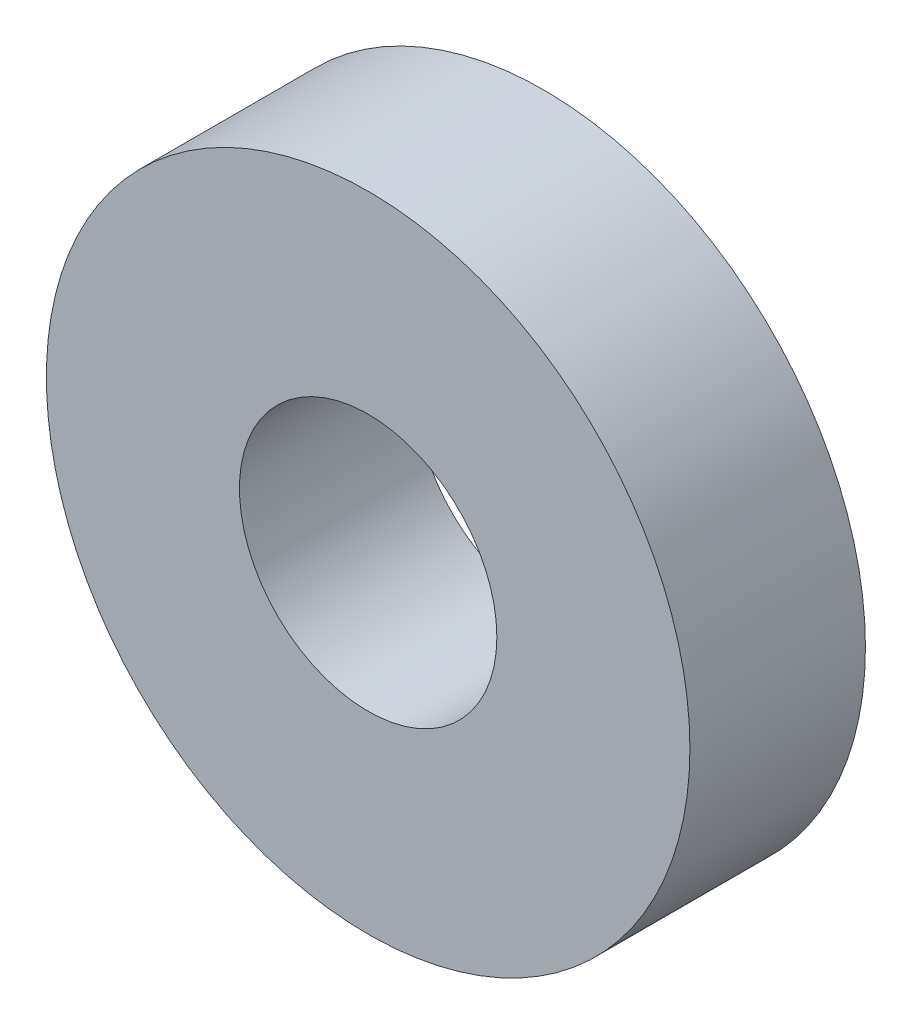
ISO-10303-21;
HEADER;
FILE_DESCRIPTION(('STEP AP214'),'2;1');
FILE_NAME('part.step','',(''),(''),'','','');
FILE_SCHEMA(('AUTOMOTIVE_DESIGN { 1 0 10303 214 1 1 1 1 }'));
ENDSEC;
DATA;
#1=APPLICATION_CONTEXT('core data for automotive mechanical design processes');
#2=APPLICATION_PROTOCOL_DEFINITION('international standard','automotive_design',2000,#1);
#3=PRODUCT_CONTEXT('',#1,'mechanical');
#4=PRODUCT('Part','Part','',(#3));
#5=PRODUCT_RELATED_PRODUCT_CATEGORY('part','',(#4));
#6=PRODUCT_DEFINITION_FORMATION('','',#4);
#7=PRODUCT_DEFINITION_CONTEXT('part definition',#1,'design');
#8=PRODUCT_DEFINITION('design','',#6,#7);
#9=PRODUCT_DEFINITION_SHAPE('','',#8);
#10=(LENGTH_UNIT() NAMED_UNIT(*) SI_UNIT(.MILLI.,.METRE.));
#11=(NAMED_UNIT(*) PLANE_ANGLE_UNIT() SI_UNIT($,.RADIAN.));
#12=(NAMED_UNIT(*) SI_UNIT($,.STERADIAN.) SOLID_ANGLE_UNIT());
#13=UNCERTAINTY_MEASURE_WITH_UNIT(LENGTH_MEASURE(1.E-05),#10,'distance_accuracy_value','');
#14=(GEOMETRIC_REPRESENTATION_CONTEXT(3) GLOBAL_UNCERTAINTY_ASSIGNED_CONTEXT((#13)) GLOBAL_UNIT_ASSIGNED_CONTEXT((#10,
#11,#12)) REPRESENTATION_CONTEXT('',''));
#15=CARTESIAN_POINT('',(0.,0.,0.));
#16=DIRECTION('',(0.,0.,1.));
#17=DIRECTION('',(1.,0.,0.));
#18=AXIS2_PLACEMENT_3D('',#15,#16,#17);
#19=CARTESIAN_POINT('',(0.,-2.00000000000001,1.5));
#20=DIRECTION('',(0.,0.,1.));
#21=DIRECTION('',(1.,0.,0.));
#22=AXIS2_PLACEMENT_3D('',#19,#20,#21);
#23=PLANE('',#22);
#24=CARTESIAN_POINT('',(0.,-2.00000000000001,1.5));
#25=DIRECTION('',(0.,0.,1.));
#26=DIRECTION('',(1.,0.,0.));
#27=AXIS2_PLACEMENT_3D('',#24,#25,#26);
#28=CIRCLE('',#27,2.75);
#29=CARTESIAN_POINT('',(2.74999999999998,-2.00000000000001,1.5));
#30=VERTEX_POINT('',#29);
#31=EDGE_CURVE('E10',#30,#30,#28,.T.);
#32=ORIENTED_EDGE('',*,*,#31,.T.);
#33=EDGE_LOOP('',(#32));
#34=FACE_BOUND('',#33,.T.);
#35=CARTESIAN_POINT('',(0.,-2.00000000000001,1.5));
#36=DIRECTION('',(0.,0.,1.));
#37=DIRECTION('',(1.,0.,0.));
#38=AXIS2_PLACEMENT_3D('',#35,#36,#37);
#39=CIRCLE('',#38,1.1);
#40=CARTESIAN_POINT('',(1.09999999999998,-2.00000000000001,1.5));
#41=VERTEX_POINT('',#40);
#42=EDGE_CURVE('E35',#41,#41,#39,.T.);
#43=ORIENTED_EDGE('',*,*,#42,.F.);
#44=EDGE_LOOP('',(#43));
#45=FACE_BOUND('',#44,.T.);
#46=ADVANCED_FACE('F24',(#34,#45),#23,.T.);
#47=CARTESIAN_POINT('',(0.,-2.00000000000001,0.));
#48=DIRECTION('',(0.,0.,1.));
#49=DIRECTION('',(1.,0.,0.));
#50=AXIS2_PLACEMENT_3D('',#47,#48,#49);
#51=PLANE('',#50);
#52=CARTESIAN_POINT('',(0.,-2.00000000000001,0.));
#53=DIRECTION('',(0.,0.,1.));
#54=DIRECTION('',(1.,0.,0.));
#55=AXIS2_PLACEMENT_3D('',#52,#53,#54);
#56=CIRCLE('',#55,2.75);
#57=CARTESIAN_POINT('',(2.74999999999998,-2.00000000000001,0.));
#58=VERTEX_POINT('',#57);
#59=EDGE_CURVE('E31',#58,#58,#56,.T.);
#60=ORIENTED_EDGE('',*,*,#59,.F.);
#61=EDGE_LOOP('',(#60));
#62=FACE_BOUND('',#61,.T.);
#63=CARTESIAN_POINT('',(0.,-2.00000000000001,0.));
#64=DIRECTION('',(0.,0.,1.));
#65=DIRECTION('',(1.,0.,0.));
#66=AXIS2_PLACEMENT_3D('',#63,#64,#65);
#67=CIRCLE('',#66,1.1);
#68=CARTESIAN_POINT('',(1.09999999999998,-2.00000000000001,0.));
#69=VERTEX_POINT('',#68);
#70=EDGE_CURVE('E39',#69,#69,#67,.T.);
#71=ORIENTED_EDGE('',*,*,#70,.T.);
#72=EDGE_LOOP('',(#71));
#73=FACE_BOUND('',#72,.T.);
#74=ADVANCED_FACE('F45',(#62,#73),#51,.F.);
#75=CARTESIAN_POINT('',(0.,-2.00000000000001,1.5));
#76=DIRECTION('',(0.,0.,-1.));
#77=DIRECTION('',(-1.,0.,0.));
#78=AXIS2_PLACEMENT_3D('',#75,#76,#77);
#79=CYLINDRICAL_SURFACE('',#78,2.75);
#80=ORIENTED_EDGE('',*,*,#31,.F.);
#81=EDGE_LOOP('',(#80));
#82=FACE_BOUND('',#81,.T.);
#83=ORIENTED_EDGE('',*,*,#59,.T.);
#84=EDGE_LOOP('',(#83));
#85=FACE_BOUND('',#84,.T.);
#86=ADVANCED_FACE('F26',(#82,#85),#79,.T.);
#87=CARTESIAN_POINT('',(0.,-2.00000000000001,1.5));
#88=DIRECTION('',(0.,0.,-1.));
#89=DIRECTION('',(-1.,0.,0.));
#90=AXIS2_PLACEMENT_3D('',#87,#88,#89);
#91=CYLINDRICAL_SURFACE('',#90,1.1);
#92=ORIENTED_EDGE('',*,*,#42,.T.);
#93=EDGE_LOOP('',(#92));
#94=FACE_BOUND('',#93,.T.);
#95=ORIENTED_EDGE('',*,*,#70,.F.);
#96=EDGE_LOOP('',(#95));
#97=FACE_BOUND('',#96,.T.);
#98=ADVANCED_FACE('F47',(#94,#97),#91,.F.);
#99=CLOSED_SHELL('',(#46,#74,#86,#98));
#100=MANIFOLD_SOLID_BREP('B2',#99);
#101=ADVANCED_BREP_SHAPE_REPRESENTATION('',(#18,#100),#14);
#102=SHAPE_DEFINITION_REPRESENTATION(#9,#101);
ENDSEC;
END-ISO-10303-21;
